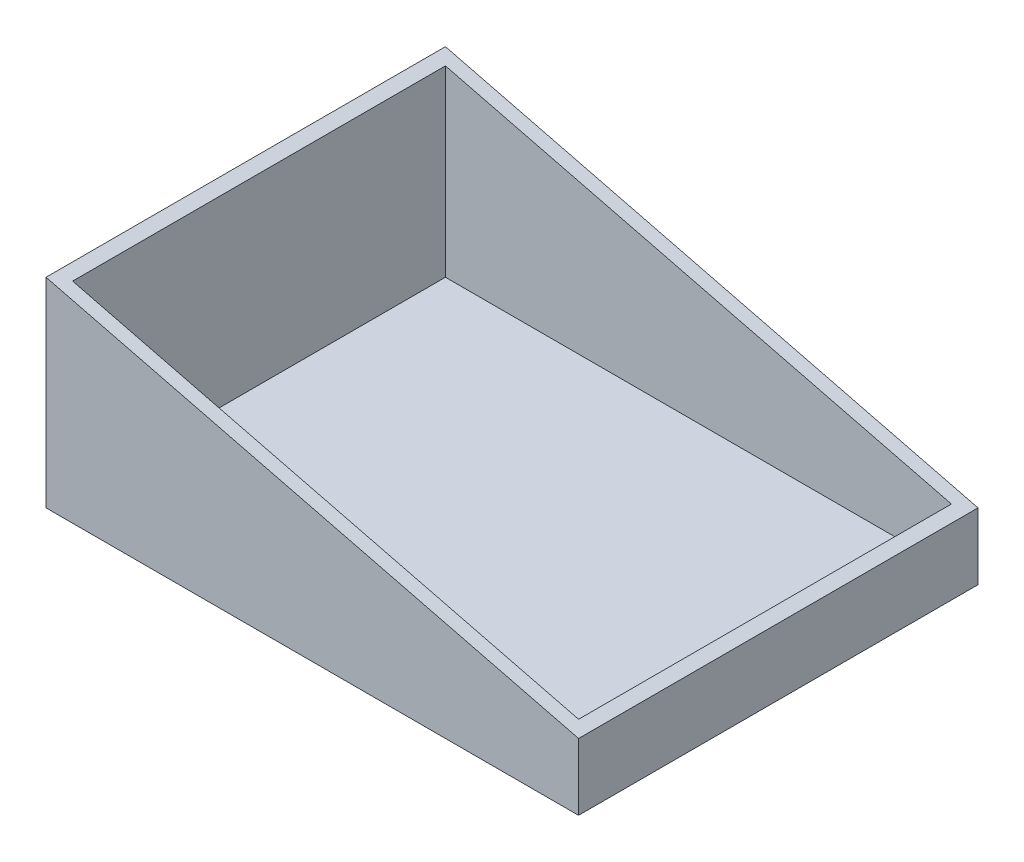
ISO-10303-21;
HEADER;
FILE_DESCRIPTION(('STEP AP214'),'2;1');
FILE_NAME('part.step','',(''),(''),'','','');
FILE_SCHEMA(('AUTOMOTIVE_DESIGN { 1 0 10303 214 1 1 1 1 }'));
ENDSEC;
DATA;
#1=APPLICATION_CONTEXT('core data for automotive mechanical design processes');
#2=APPLICATION_PROTOCOL_DEFINITION('international standard','automotive_design',2000,#1);
#3=PRODUCT_CONTEXT('',#1,'mechanical');
#4=PRODUCT('Part','Part','',(#3));
#5=PRODUCT_RELATED_PRODUCT_CATEGORY('part','',(#4));
#6=PRODUCT_DEFINITION_FORMATION('','',#4);
#7=PRODUCT_DEFINITION_CONTEXT('part definition',#1,'design');
#8=PRODUCT_DEFINITION('design','',#6,#7);
#9=PRODUCT_DEFINITION_SHAPE('','',#8);
#10=(LENGTH_UNIT() NAMED_UNIT(*) SI_UNIT(.MILLI.,.METRE.));
#11=(NAMED_UNIT(*) PLANE_ANGLE_UNIT() SI_UNIT($,.RADIAN.));
#12=(NAMED_UNIT(*) SI_UNIT($,.STERADIAN.) SOLID_ANGLE_UNIT());
#13=UNCERTAINTY_MEASURE_WITH_UNIT(LENGTH_MEASURE(1.E-05),#10,'distance_accuracy_value','');
#14=(GEOMETRIC_REPRESENTATION_CONTEXT(3) GLOBAL_UNCERTAINTY_ASSIGNED_CONTEXT((#13)) GLOBAL_UNIT_ASSIGNED_CONTEXT((#10,
#11,#12)) REPRESENTATION_CONTEXT('',''));
#15=CARTESIAN_POINT('',(0.,0.,0.));
#16=DIRECTION('',(0.,0.,1.));
#17=DIRECTION('',(1.,0.,0.));
#18=AXIS2_PLACEMENT_3D('',#15,#16,#17);
#19=CARTESIAN_POINT('',(0.,38.1,-76.2));
#20=DIRECTION('',(0.242535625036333,0.970142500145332,0.));
#21=DIRECTION('',(-0.970142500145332,0.242535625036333,0.));
#22=AXIS2_PLACEMENT_3D('',#19,#20,#21);
#23=PLANE('',#22);
#24=DIRECTION('',(-0.970142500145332,0.242535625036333,0.));
#25=VECTOR('',#24,1.);
#26=CARTESIAN_POINT('',(0.,38.1,0.));
#27=LINE('',#26,#25);
#28=CARTESIAN_POINT('',(101.6,12.7,0.));
#29=VERTEX_POINT('',#28);
#30=CARTESIAN_POINT('',(0.,38.1,0.));
#31=VERTEX_POINT('',#30);
#32=EDGE_CURVE('E141',#29,#31,#27,.T.);
#33=ORIENTED_EDGE('',*,*,#32,.F.);
#34=DIRECTION('',(0.,0.,1.));
#35=VECTOR('',#34,1.);
#36=CARTESIAN_POINT('',(101.6,12.7,-76.2));
#37=LINE('',#36,#35);
#38=CARTESIAN_POINT('',(101.6,12.7,-76.2));
#39=VERTEX_POINT('',#38);
#40=EDGE_CURVE('E158',#39,#29,#37,.T.);
#41=ORIENTED_EDGE('',*,*,#40,.F.);
#42=DIRECTION('',(-0.970142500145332,0.242535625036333,0.));
#43=VECTOR('',#42,1.);
#44=CARTESIAN_POINT('',(0.,38.1,-76.2));
#45=LINE('',#44,#43);
#46=CARTESIAN_POINT('',(0.,38.1,-76.2));
#47=VERTEX_POINT('',#46);
#48=EDGE_CURVE('E152',#39,#47,#45,.T.);
#49=ORIENTED_EDGE('',*,*,#48,.T.);
#50=DIRECTION('',(0.,0.,1.));
#51=VECTOR('',#50,1.);
#52=CARTESIAN_POINT('',(0.,38.1,-76.2));
#53=LINE('',#52,#51);
#54=EDGE_CURVE('E40',#47,#31,#53,.T.);
#55=ORIENTED_EDGE('',*,*,#54,.T.);
#56=EDGE_LOOP('',(#33,#41,#49,#55));
#57=FACE_BOUND('',#56,.T.);
#58=DIRECTION('',(0.,0.,1.));
#59=VECTOR('',#58,1.);
#60=CARTESIAN_POINT('',(99.06,13.335,-76.2));
#61=LINE('',#60,#59);
#62=CARTESIAN_POINT('',(99.06,13.335,-73.66));
#63=VERTEX_POINT('',#62);
#64=CARTESIAN_POINT('',(99.06,13.335,-2.54));
#65=VERTEX_POINT('',#64);
#66=EDGE_CURVE('E120',#63,#65,#61,.T.);
#67=ORIENTED_EDGE('',*,*,#66,.T.);
#68=DIRECTION('',(-0.970142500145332,0.242535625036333,0.));
#69=VECTOR('',#68,1.);
#70=CARTESIAN_POINT('',(0.,38.1,-2.54));
#71=LINE('',#70,#69);
#72=CARTESIAN_POINT('',(2.54,37.465,-2.54));
#73=VERTEX_POINT('',#72);
#74=EDGE_CURVE('E129',#65,#73,#71,.T.);
#75=ORIENTED_EDGE('',*,*,#74,.T.);
#76=DIRECTION('',(0.,0.,1.));
#77=VECTOR('',#76,1.);
#78=CARTESIAN_POINT('',(2.54,37.465,-76.2));
#79=LINE('',#78,#77);
#80=CARTESIAN_POINT('',(2.54,37.465,-73.66));
#81=VERTEX_POINT('',#80);
#82=EDGE_CURVE('E104',#81,#73,#79,.T.);
#83=ORIENTED_EDGE('',*,*,#82,.F.);
#84=DIRECTION('',(-0.970142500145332,0.242535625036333,0.));
#85=VECTOR('',#84,1.);
#86=CARTESIAN_POINT('',(0.,38.1,-73.66));
#87=LINE('',#86,#85);
#88=EDGE_CURVE('E117',#63,#81,#87,.T.);
#89=ORIENTED_EDGE('',*,*,#88,.F.);
#90=EDGE_LOOP('',(#67,#75,#83,#89));
#91=FACE_BOUND('',#90,.T.);
#92=ADVANCED_FACE('F31',(#57,#91),#23,.T.);
#93=CARTESIAN_POINT('',(101.6,0.,-76.2));
#94=DIRECTION('',(0.,-1.,0.));
#95=DIRECTION('',(1.,0.,0.));
#96=AXIS2_PLACEMENT_3D('',#93,#94,#95);
#97=PLANE('',#96);
#98=DIRECTION('',(1.,0.,0.));
#99=VECTOR('',#98,1.);
#100=CARTESIAN_POINT('',(101.6,0.,0.));
#101=LINE('',#100,#99);
#102=CARTESIAN_POINT('',(0.,0.,0.));
#103=VERTEX_POINT('',#102);
#104=CARTESIAN_POINT('',(101.6,0.,0.));
#105=VERTEX_POINT('',#104);
#106=EDGE_CURVE('E103',#103,#105,#101,.T.);
#107=ORIENTED_EDGE('',*,*,#106,.F.);
#108=DIRECTION('',(0.,0.,1.));
#109=VECTOR('',#108,1.);
#110=CARTESIAN_POINT('',(0.,0.,-76.2));
#111=LINE('',#110,#109);
#112=CARTESIAN_POINT('',(0.,0.,-76.2));
#113=VERTEX_POINT('',#112);
#114=EDGE_CURVE('E11',#113,#103,#111,.T.);
#115=ORIENTED_EDGE('',*,*,#114,.F.);
#116=DIRECTION('',(1.,0.,0.));
#117=VECTOR('',#116,1.);
#118=CARTESIAN_POINT('',(101.6,0.,-76.2));
#119=LINE('',#118,#117);
#120=CARTESIAN_POINT('',(101.6,0.,-76.2));
#121=VERTEX_POINT('',#120);
#122=EDGE_CURVE('E147',#113,#121,#119,.T.);
#123=ORIENTED_EDGE('',*,*,#122,.T.);
#124=DIRECTION('',(0.,0.,1.));
#125=VECTOR('',#124,1.);
#126=CARTESIAN_POINT('',(101.6,0.,-76.2));
#127=LINE('',#126,#125);
#128=EDGE_CURVE('E35',#121,#105,#127,.T.);
#129=ORIENTED_EDGE('',*,*,#128,.T.);
#130=EDGE_LOOP('',(#107,#115,#123,#129));
#131=FACE_BOUND('',#130,.T.);
#132=ADVANCED_FACE('F33',(#131),#97,.T.);
#133=CARTESIAN_POINT('',(0.,0.,-76.2));
#134=DIRECTION('',(-1.,0.,0.));
#135=DIRECTION('',(0.,0.,1.));
#136=AXIS2_PLACEMENT_3D('',#133,#134,#135);
#137=PLANE('',#136);
#138=DIRECTION('',(0.,-1.,0.));
#139=VECTOR('',#138,1.);
#140=CARTESIAN_POINT('',(0.,0.,0.));
#141=LINE('',#140,#139);
#142=EDGE_CURVE('E144',#31,#103,#141,.T.);
#143=ORIENTED_EDGE('',*,*,#142,.F.);
#144=ORIENTED_EDGE('',*,*,#54,.F.);
#145=DIRECTION('',(0.,-1.,0.));
#146=VECTOR('',#145,1.);
#147=CARTESIAN_POINT('',(0.,0.,-76.2));
#148=LINE('',#147,#146);
#149=EDGE_CURVE('E155',#47,#113,#148,.T.);
#150=ORIENTED_EDGE('',*,*,#149,.T.);
#151=ORIENTED_EDGE('',*,*,#114,.T.);
#152=EDGE_LOOP('',(#143,#144,#150,#151));
#153=FACE_BOUND('',#152,.T.);
#154=ADVANCED_FACE('F168',(#153),#137,.T.);
#155=CARTESIAN_POINT('',(101.6,12.7,-76.2));
#156=DIRECTION('',(1.,0.,0.));
#157=DIRECTION('',(0.,0.,-1.));
#158=AXIS2_PLACEMENT_3D('',#155,#156,#157);
#159=PLANE('',#158);
#160=DIRECTION('',(0.,1.,0.));
#161=VECTOR('',#160,1.);
#162=CARTESIAN_POINT('',(101.6,12.7,0.));
#163=LINE('',#162,#161);
#164=EDGE_CURVE('E138',#105,#29,#163,.T.);
#165=ORIENTED_EDGE('',*,*,#164,.F.);
#166=ORIENTED_EDGE('',*,*,#128,.F.);
#167=DIRECTION('',(0.,1.,0.));
#168=VECTOR('',#167,1.);
#169=CARTESIAN_POINT('',(101.6,12.7,-76.2));
#170=LINE('',#169,#168);
#171=EDGE_CURVE('E149',#121,#39,#170,.T.);
#172=ORIENTED_EDGE('',*,*,#171,.T.);
#173=ORIENTED_EDGE('',*,*,#40,.T.);
#174=EDGE_LOOP('',(#165,#166,#172,#173));
#175=FACE_BOUND('',#174,.T.);
#176=ADVANCED_FACE('F163',(#175),#159,.T.);
#177=CARTESIAN_POINT('',(0.,0.,-76.2));
#178=DIRECTION('',(0.,0.,-1.));
#179=DIRECTION('',(-1.,0.,0.));
#180=AXIS2_PLACEMENT_3D('',#177,#178,#179);
#181=PLANE('',#180);
#182=ORIENTED_EDGE('',*,*,#122,.F.);
#183=ORIENTED_EDGE('',*,*,#149,.F.);
#184=ORIENTED_EDGE('',*,*,#48,.F.);
#185=ORIENTED_EDGE('',*,*,#171,.F.);
#186=EDGE_LOOP('',(#182,#183,#184,#185));
#187=FACE_BOUND('',#186,.T.);
#188=ADVANCED_FACE('F172',(#187),#181,.T.);
#189=CARTESIAN_POINT('',(0.,0.,0.));
#190=DIRECTION('',(0.,0.,-1.));
#191=DIRECTION('',(-1.,0.,0.));
#192=AXIS2_PLACEMENT_3D('',#189,#190,#191);
#193=PLANE('',#192);
#194=ORIENTED_EDGE('',*,*,#106,.T.);
#195=ORIENTED_EDGE('',*,*,#164,.T.);
#196=ORIENTED_EDGE('',*,*,#32,.T.);
#197=ORIENTED_EDGE('',*,*,#142,.T.);
#198=EDGE_LOOP('',(#194,#195,#196,#197));
#199=FACE_BOUND('',#198,.T.);
#200=ADVANCED_FACE('F165',(#199),#193,.F.);
#201=CARTESIAN_POINT('',(101.6,2.54,-76.2));
#202=DIRECTION('',(0.,-1.,0.));
#203=DIRECTION('',(1.,0.,0.));
#204=AXIS2_PLACEMENT_3D('',#201,#202,#203);
#205=PLANE('',#204);
#206=DIRECTION('',(1.,0.,0.));
#207=VECTOR('',#206,1.);
#208=CARTESIAN_POINT('',(101.6,2.54,-2.54));
#209=LINE('',#208,#207);
#210=CARTESIAN_POINT('',(2.54,2.54,-2.54));
#211=VERTEX_POINT('',#210);
#212=CARTESIAN_POINT('',(99.06,2.54,-2.54));
#213=VERTEX_POINT('',#212);
#214=EDGE_CURVE('E130',#211,#213,#209,.T.);
#215=ORIENTED_EDGE('',*,*,#214,.T.);
#216=DIRECTION('',(0.,0.,1.));
#217=VECTOR('',#216,1.);
#218=CARTESIAN_POINT('',(99.06,2.54,-76.2));
#219=LINE('',#218,#217);
#220=CARTESIAN_POINT('',(99.06,2.54,-73.66));
#221=VERTEX_POINT('',#220);
#222=EDGE_CURVE('E109',#221,#213,#219,.T.);
#223=ORIENTED_EDGE('',*,*,#222,.F.);
#224=DIRECTION('',(1.,0.,0.));
#225=VECTOR('',#224,1.);
#226=CARTESIAN_POINT('',(101.6,2.54,-73.66));
#227=LINE('',#226,#225);
#228=CARTESIAN_POINT('',(2.54,2.54,-73.66));
#229=VERTEX_POINT('',#228);
#230=EDGE_CURVE('E107',#229,#221,#227,.T.);
#231=ORIENTED_EDGE('',*,*,#230,.F.);
#232=DIRECTION('',(0.,0.,1.));
#233=VECTOR('',#232,1.);
#234=CARTESIAN_POINT('',(2.54,2.54,-76.2));
#235=LINE('',#234,#233);
#236=EDGE_CURVE('E95',#229,#211,#235,.T.);
#237=ORIENTED_EDGE('',*,*,#236,.T.);
#238=EDGE_LOOP('',(#215,#223,#231,#237));
#239=FACE_BOUND('',#238,.T.);
#240=ADVANCED_FACE('F108',(#239),#205,.F.);
#241=CARTESIAN_POINT('',(2.54,0.,-76.2));
#242=DIRECTION('',(-1.,0.,0.));
#243=DIRECTION('',(0.,0.,1.));
#244=AXIS2_PLACEMENT_3D('',#241,#242,#243);
#245=PLANE('',#244);
#246=DIRECTION('',(0.,-1.,0.));
#247=VECTOR('',#246,1.);
#248=CARTESIAN_POINT('',(2.54,0.,-2.54));
#249=LINE('',#248,#247);
#250=EDGE_CURVE('E99',#73,#211,#249,.T.);
#251=ORIENTED_EDGE('',*,*,#250,.T.);
#252=ORIENTED_EDGE('',*,*,#236,.F.);
#253=DIRECTION('',(0.,-1.,0.));
#254=VECTOR('',#253,1.);
#255=CARTESIAN_POINT('',(2.54,0.,-73.66));
#256=LINE('',#255,#254);
#257=EDGE_CURVE('E48',#81,#229,#256,.T.);
#258=ORIENTED_EDGE('',*,*,#257,.F.);
#259=ORIENTED_EDGE('',*,*,#82,.T.);
#260=EDGE_LOOP('',(#251,#252,#258,#259));
#261=FACE_BOUND('',#260,.T.);
#262=ADVANCED_FACE('F97',(#261),#245,.F.);
#263=CARTESIAN_POINT('',(99.06,12.7,-76.2));
#264=DIRECTION('',(1.,0.,0.));
#265=DIRECTION('',(0.,0.,-1.));
#266=AXIS2_PLACEMENT_3D('',#263,#264,#265);
#267=PLANE('',#266);
#268=DIRECTION('',(0.,1.,0.));
#269=VECTOR('',#268,1.);
#270=CARTESIAN_POINT('',(99.06,12.7,-2.54));
#271=LINE('',#270,#269);
#272=EDGE_CURVE('E126',#213,#65,#271,.T.);
#273=ORIENTED_EDGE('',*,*,#272,.T.);
#274=ORIENTED_EDGE('',*,*,#66,.F.);
#275=DIRECTION('',(0.,1.,0.));
#276=VECTOR('',#275,1.);
#277=CARTESIAN_POINT('',(99.06,12.7,-73.66));
#278=LINE('',#277,#276);
#279=EDGE_CURVE('E113',#221,#63,#278,.T.);
#280=ORIENTED_EDGE('',*,*,#279,.F.);
#281=ORIENTED_EDGE('',*,*,#222,.T.);
#282=EDGE_LOOP('',(#273,#274,#280,#281));
#283=FACE_BOUND('',#282,.T.);
#284=ADVANCED_FACE('F178',(#283),#267,.F.);
#285=CARTESIAN_POINT('',(0.,0.,-73.66));
#286=DIRECTION('',(0.,0.,-1.));
#287=DIRECTION('',(-1.,0.,0.));
#288=AXIS2_PLACEMENT_3D('',#285,#286,#287);
#289=PLANE('',#288);
#290=ORIENTED_EDGE('',*,*,#230,.T.);
#291=ORIENTED_EDGE('',*,*,#279,.T.);
#292=ORIENTED_EDGE('',*,*,#88,.T.);
#293=ORIENTED_EDGE('',*,*,#257,.T.);
#294=EDGE_LOOP('',(#290,#291,#292,#293));
#295=FACE_BOUND('',#294,.T.);
#296=ADVANCED_FACE('F115',(#295),#289,.F.);
#297=CARTESIAN_POINT('',(0.,0.,-2.54));
#298=DIRECTION('',(0.,0.,-1.));
#299=DIRECTION('',(-1.,0.,0.));
#300=AXIS2_PLACEMENT_3D('',#297,#298,#299);
#301=PLANE('',#300);
#302=ORIENTED_EDGE('',*,*,#214,.F.);
#303=ORIENTED_EDGE('',*,*,#250,.F.);
#304=ORIENTED_EDGE('',*,*,#74,.F.);
#305=ORIENTED_EDGE('',*,*,#272,.F.);
#306=EDGE_LOOP('',(#302,#303,#304,#305));
#307=FACE_BOUND('',#306,.T.);
#308=ADVANCED_FACE('F181',(#307),#301,.T.);
#309=CLOSED_SHELL('',(#92,#132,#154,#176,#188,#200,#240,#262,#284,#296,#308));
#310=MANIFOLD_SOLID_BREP('B2',#309);
#311=ADVANCED_BREP_SHAPE_REPRESENTATION('',(#18,#310),#14);
#312=SHAPE_DEFINITION_REPRESENTATION(#9,#311);
ENDSEC;
END-ISO-10303-21;
